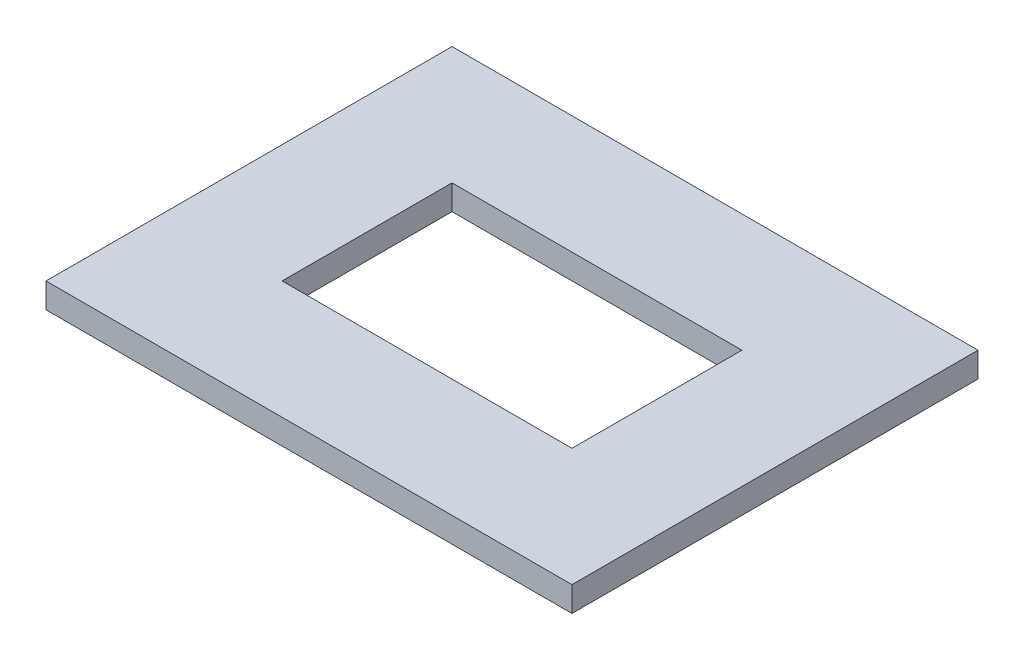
from build123d import *

# Parameters (mm, degrees)
SKETCH1_W           = 334.15
SKETCH1_H           = 257.95
SKETCH1_W_2         = 184.15
SKETCH1_H_2         = 107.95
BOSS_EXTRUDE1_DEPTH = 15.875


with BuildPart() as part:
    # Sketch1 → Boss-Extrude1 (new body)
    with BuildSketch(Plane(origin=(0, 0, 0), x_dir=(1, 0, 0), z_dir=(0, 1, 0))):
        Rectangle(SKETCH1_W, SKETCH1_H)
        Rectangle(SKETCH1_W_2, SKETCH1_H_2, mode=Mode.SUBTRACT)
    extrude(amount=BOSS_EXTRUDE1_DEPTH)


solid = part.part
